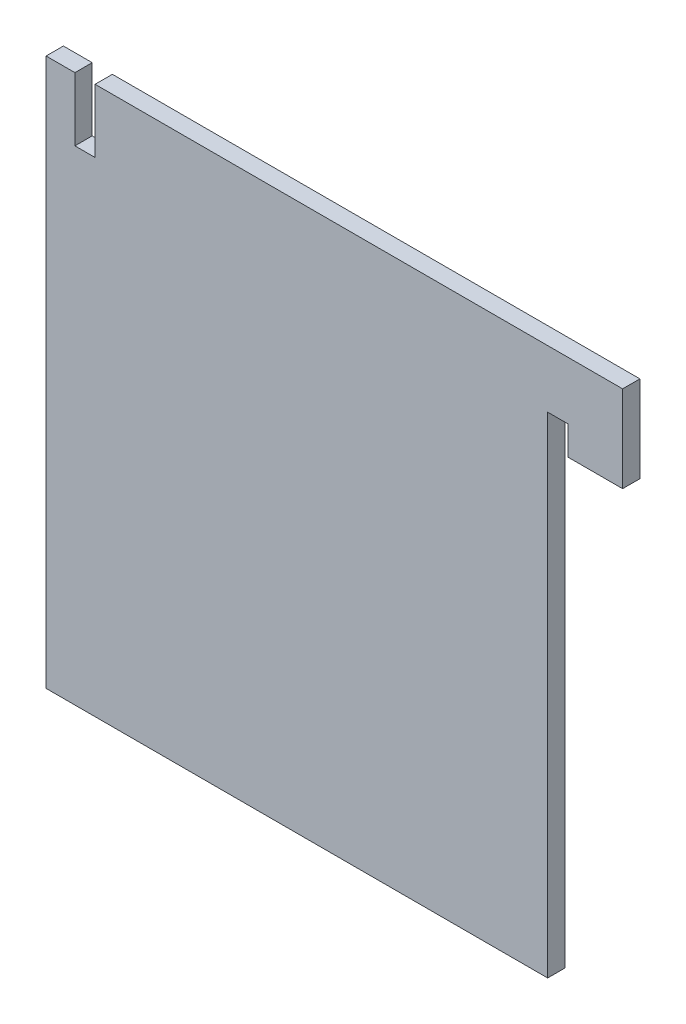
ISO-10303-21;
HEADER;
FILE_DESCRIPTION(('STEP AP214'),'2;1');
FILE_NAME('part.step','',(''),(''),'','','');
FILE_SCHEMA(('AUTOMOTIVE_DESIGN { 1 0 10303 214 1 1 1 1 }'));
ENDSEC;
DATA;
#1=APPLICATION_CONTEXT('core data for automotive mechanical design processes');
#2=APPLICATION_PROTOCOL_DEFINITION('international standard','automotive_design',2000,#1);
#3=PRODUCT_CONTEXT('',#1,'mechanical');
#4=PRODUCT('Part','Part','',(#3));
#5=PRODUCT_RELATED_PRODUCT_CATEGORY('part','',(#4));
#6=PRODUCT_DEFINITION_FORMATION('','',#4);
#7=PRODUCT_DEFINITION_CONTEXT('part definition',#1,'design');
#8=PRODUCT_DEFINITION('design','',#6,#7);
#9=PRODUCT_DEFINITION_SHAPE('','',#8);
#10=(LENGTH_UNIT() NAMED_UNIT(*) SI_UNIT(.MILLI.,.METRE.));
#11=(NAMED_UNIT(*) PLANE_ANGLE_UNIT() SI_UNIT($,.RADIAN.));
#12=(NAMED_UNIT(*) SI_UNIT($,.STERADIAN.) SOLID_ANGLE_UNIT());
#13=UNCERTAINTY_MEASURE_WITH_UNIT(LENGTH_MEASURE(1.E-05),#10,'distance_accuracy_value','');
#14=(GEOMETRIC_REPRESENTATION_CONTEXT(3) GLOBAL_UNCERTAINTY_ASSIGNED_CONTEXT((#13)) GLOBAL_UNIT_ASSIGNED_CONTEXT((#10,
#11,#12)) REPRESENTATION_CONTEXT('',''));
#15=CARTESIAN_POINT('',(0.,0.,0.));
#16=DIRECTION('',(0.,0.,1.));
#17=DIRECTION('',(1.,0.,0.));
#18=AXIS2_PLACEMENT_3D('',#15,#16,#17);
#19=CARTESIAN_POINT('',(0.,95.,3.));
#20=DIRECTION('',(0.,-1.,0.));
#21=DIRECTION('',(0.,0.,-1.));
#22=AXIS2_PLACEMENT_3D('',#19,#20,#21);
#23=PLANE('',#22);
#24=DIRECTION('',(-1.,0.,0.));
#25=VECTOR('',#24,1.);
#26=CARTESIAN_POINT('',(0.,95.,3.));
#27=LINE('',#26,#25);
#28=CARTESIAN_POINT('',(5.,95.,3.));
#29=VERTEX_POINT('',#28);
#30=CARTESIAN_POINT('',(0.,95.,3.));
#31=VERTEX_POINT('',#30);
#32=EDGE_CURVE('E194',#29,#31,#27,.T.);
#33=ORIENTED_EDGE('',*,*,#32,.F.);
#34=DIRECTION('',(0.,0.,1.));
#35=VECTOR('',#34,1.);
#36=CARTESIAN_POINT('',(5.,95.,0.));
#37=LINE('',#36,#35);
#38=CARTESIAN_POINT('',(5.,95.,0.));
#39=VERTEX_POINT('',#38);
#40=EDGE_CURVE('E163',#39,#29,#37,.T.);
#41=ORIENTED_EDGE('',*,*,#40,.F.);
#42=DIRECTION('',(-1.,0.,0.));
#43=VECTOR('',#42,1.);
#44=CARTESIAN_POINT('',(0.,95.,0.));
#45=LINE('',#44,#43);
#46=CARTESIAN_POINT('',(0.,95.,0.));
#47=VERTEX_POINT('',#46);
#48=EDGE_CURVE('E206',#39,#47,#45,.T.);
#49=ORIENTED_EDGE('',*,*,#48,.T.);
#50=DIRECTION('',(0.,0.,-1.));
#51=VECTOR('',#50,1.);
#52=CARTESIAN_POINT('',(0.,95.,3.));
#53=LINE('',#52,#51);
#54=EDGE_CURVE('E198',#31,#47,#53,.T.);
#55=ORIENTED_EDGE('',*,*,#54,.F.);
#56=EDGE_LOOP('',(#33,#41,#49,#55));
#57=FACE_BOUND('',#56,.T.);
#58=ADVANCED_FACE('F30',(#57),#23,.F.);
#59=CARTESIAN_POINT('',(0.,0.,3.));
#60=DIRECTION('',(1.,0.,0.));
#61=DIRECTION('',(0.,0.,-1.));
#62=AXIS2_PLACEMENT_3D('',#59,#60,#61);
#63=PLANE('',#62);
#64=DIRECTION('',(0.,-1.,0.));
#65=VECTOR('',#64,1.);
#66=CARTESIAN_POINT('',(0.,0.,0.));
#67=LINE('',#66,#65);
#68=CARTESIAN_POINT('',(0.,0.,0.));
#69=VERTEX_POINT('',#68);
#70=EDGE_CURVE('E183',#47,#69,#67,.T.);
#71=ORIENTED_EDGE('',*,*,#70,.T.);
#72=DIRECTION('',(0.,0.,-1.));
#73=VECTOR('',#72,1.);
#74=CARTESIAN_POINT('',(0.,0.,3.));
#75=LINE('',#74,#73);
#76=CARTESIAN_POINT('',(0.,0.,3.));
#77=VERTEX_POINT('',#76);
#78=EDGE_CURVE('E11',#77,#69,#75,.T.);
#79=ORIENTED_EDGE('',*,*,#78,.F.);
#80=DIRECTION('',(0.,-1.,0.));
#81=VECTOR('',#80,1.);
#82=CARTESIAN_POINT('',(0.,0.,3.));
#83=LINE('',#82,#81);
#84=EDGE_CURVE('E185',#31,#77,#83,.T.);
#85=ORIENTED_EDGE('',*,*,#84,.F.);
#86=ORIENTED_EDGE('',*,*,#54,.T.);
#87=EDGE_LOOP('',(#71,#79,#85,#86));
#88=FACE_BOUND('',#87,.T.);
#89=ADVANCED_FACE('F32',(#88),#63,.F.);
#90=CARTESIAN_POINT('',(0.,0.,3.));
#91=DIRECTION('',(0.,1.,0.));
#92=DIRECTION('',(0.,0.,1.));
#93=AXIS2_PLACEMENT_3D('',#90,#91,#92);
#94=PLANE('',#93);
#95=DIRECTION('',(1.,0.,0.));
#96=VECTOR('',#95,1.);
#97=CARTESIAN_POINT('',(0.,0.,0.));
#98=LINE('',#97,#96);
#99=CARTESIAN_POINT('',(87.,0.,0.));
#100=VERTEX_POINT('',#99);
#101=EDGE_CURVE('E201',#69,#100,#98,.T.);
#102=ORIENTED_EDGE('',*,*,#101,.T.);
#103=DIRECTION('',(0.,0.,1.));
#104=VECTOR('',#103,1.);
#105=CARTESIAN_POINT('',(87.,0.,0.));
#106=LINE('',#105,#104);
#107=CARTESIAN_POINT('',(87.,0.,3.));
#108=VERTEX_POINT('',#107);
#109=EDGE_CURVE('E180',#100,#108,#106,.T.);
#110=ORIENTED_EDGE('',*,*,#109,.T.);
#111=DIRECTION('',(1.,0.,0.));
#112=VECTOR('',#111,1.);
#113=CARTESIAN_POINT('',(0.,0.,3.));
#114=LINE('',#113,#112);
#115=EDGE_CURVE('E188',#77,#108,#114,.T.);
#116=ORIENTED_EDGE('',*,*,#115,.F.);
#117=ORIENTED_EDGE('',*,*,#78,.T.);
#118=EDGE_LOOP('',(#102,#110,#116,#117));
#119=FACE_BOUND('',#118,.T.);
#120=ADVANCED_FACE('F236',(#119),#94,.F.);
#121=CARTESIAN_POINT('',(100.,0.,3.));
#122=DIRECTION('',(-1.,0.,0.));
#123=DIRECTION('',(0.,0.,1.));
#124=AXIS2_PLACEMENT_3D('',#121,#122,#123);
#125=PLANE('',#124);
#126=DIRECTION('',(0.,1.,0.));
#127=VECTOR('',#126,1.);
#128=CARTESIAN_POINT('',(100.,0.,3.));
#129=LINE('',#128,#127);
#130=CARTESIAN_POINT('',(100.,80.,3.));
#131=VERTEX_POINT('',#130);
#132=CARTESIAN_POINT('',(100.,95.,3.));
#133=VERTEX_POINT('',#132);
#134=EDGE_CURVE('E192',#131,#133,#129,.T.);
#135=ORIENTED_EDGE('',*,*,#134,.F.);
#136=DIRECTION('',(0.,0.,1.));
#137=VECTOR('',#136,1.);
#138=CARTESIAN_POINT('',(100.,80.,0.));
#139=LINE('',#138,#137);
#140=CARTESIAN_POINT('',(100.,80.,0.));
#141=VERTEX_POINT('',#140);
#142=EDGE_CURVE('E176',#141,#131,#139,.T.);
#143=ORIENTED_EDGE('',*,*,#142,.F.);
#144=DIRECTION('',(0.,1.,0.));
#145=VECTOR('',#144,1.);
#146=CARTESIAN_POINT('',(100.,0.,0.));
#147=LINE('',#146,#145);
#148=CARTESIAN_POINT('',(100.,95.,0.));
#149=VERTEX_POINT('',#148);
#150=EDGE_CURVE('E204',#141,#149,#147,.T.);
#151=ORIENTED_EDGE('',*,*,#150,.T.);
#152=DIRECTION('',(0.,0.,-1.));
#153=VECTOR('',#152,1.);
#154=CARTESIAN_POINT('',(100.,95.,3.));
#155=LINE('',#154,#153);
#156=EDGE_CURVE('E38',#133,#149,#155,.T.);
#157=ORIENTED_EDGE('',*,*,#156,.F.);
#158=EDGE_LOOP('',(#135,#143,#151,#157));
#159=FACE_BOUND('',#158,.T.);
#160=ADVANCED_FACE('F229',(#159),#125,.F.);
#161=CARTESIAN_POINT('',(8.5,95.,0.));
#162=VERTEX_POINT('',#161);
#163=EDGE_CURVE('E189',#149,#162,#45,.T.);
#164=ORIENTED_EDGE('',*,*,#163,.T.);
#165=DIRECTION('',(0.,0.,1.));
#166=VECTOR('',#165,1.);
#167=CARTESIAN_POINT('',(8.5,95.,0.));
#168=LINE('',#167,#166);
#169=CARTESIAN_POINT('',(8.5,95.,3.));
#170=VERTEX_POINT('',#169);
#171=EDGE_CURVE('E166',#162,#170,#168,.T.);
#172=ORIENTED_EDGE('',*,*,#171,.T.);
#173=EDGE_CURVE('E195',#133,#170,#27,.T.);
#174=ORIENTED_EDGE('',*,*,#173,.F.);
#175=ORIENTED_EDGE('',*,*,#156,.T.);
#176=EDGE_LOOP('',(#164,#172,#174,#175));
#177=FACE_BOUND('',#176,.T.);
#178=ADVANCED_FACE('F215',(#177),#23,.F.);
#179=CARTESIAN_POINT('',(0.,95.,3.));
#180=DIRECTION('',(0.,0.,-1.));
#181=DIRECTION('',(-1.,0.,0.));
#182=AXIS2_PLACEMENT_3D('',#179,#180,#181);
#183=PLANE('',#182);
#184=DIRECTION('',(0.,-1.,0.));
#185=VECTOR('',#184,1.);
#186=CARTESIAN_POINT('',(87.,0.,3.));
#187=LINE('',#186,#185);
#188=CARTESIAN_POINT('',(87.,85.,3.));
#189=VERTEX_POINT('',#188);
#190=EDGE_CURVE('E174',#189,#108,#187,.T.);
#191=ORIENTED_EDGE('',*,*,#190,.F.);
#192=DIRECTION('',(-1.,0.,0.));
#193=VECTOR('',#192,1.);
#194=CARTESIAN_POINT('',(87.,85.,3.));
#195=LINE('',#194,#193);
#196=CARTESIAN_POINT('',(90.5,85.,3.));
#197=VERTEX_POINT('',#196);
#198=EDGE_CURVE('E140',#197,#189,#195,.T.);
#199=ORIENTED_EDGE('',*,*,#198,.F.);
#200=DIRECTION('',(0.,1.,0.));
#201=VECTOR('',#200,1.);
#202=CARTESIAN_POINT('',(90.5,80.,3.));
#203=LINE('',#202,#201);
#204=CARTESIAN_POINT('',(90.5,80.,3.));
#205=VERTEX_POINT('',#204);
#206=EDGE_CURVE('E121',#205,#197,#203,.T.);
#207=ORIENTED_EDGE('',*,*,#206,.F.);
#208=DIRECTION('',(-1.,0.,0.));
#209=VECTOR('',#208,1.);
#210=CARTESIAN_POINT('',(100.,80.,3.));
#211=LINE('',#210,#209);
#212=EDGE_CURVE('E165',#131,#205,#211,.T.);
#213=ORIENTED_EDGE('',*,*,#212,.F.);
#214=ORIENTED_EDGE('',*,*,#134,.T.);
#215=ORIENTED_EDGE('',*,*,#173,.T.);
#216=DIRECTION('',(0.,1.,0.));
#217=VECTOR('',#216,1.);
#218=CARTESIAN_POINT('',(8.5,95.,3.));
#219=LINE('',#218,#217);
#220=CARTESIAN_POINT('',(8.5,84.,3.));
#221=VERTEX_POINT('',#220);
#222=EDGE_CURVE('E152',#221,#170,#219,.T.);
#223=ORIENTED_EDGE('',*,*,#222,.F.);
#224=DIRECTION('',(1.,0.,0.));
#225=VECTOR('',#224,1.);
#226=CARTESIAN_POINT('',(5.,84.,3.));
#227=LINE('',#226,#225);
#228=CARTESIAN_POINT('',(5.,84.,3.));
#229=VERTEX_POINT('',#228);
#230=EDGE_CURVE('E159',#229,#221,#227,.T.);
#231=ORIENTED_EDGE('',*,*,#230,.F.);
#232=DIRECTION('',(0.,-1.,0.));
#233=VECTOR('',#232,1.);
#234=CARTESIAN_POINT('',(5.,95.,3.));
#235=LINE('',#234,#233);
#236=EDGE_CURVE('E145',#29,#229,#235,.T.);
#237=ORIENTED_EDGE('',*,*,#236,.F.);
#238=ORIENTED_EDGE('',*,*,#32,.T.);
#239=ORIENTED_EDGE('',*,*,#84,.T.);
#240=ORIENTED_EDGE('',*,*,#115,.T.);
#241=EDGE_LOOP('',(#191,#199,#207,#213,#214,#215,#223,#231,#237,#238,#239,#240));
#242=FACE_BOUND('',#241,.T.);
#243=ADVANCED_FACE('F226',(#242),#183,.F.);
#244=CARTESIAN_POINT('',(0.,95.,0.));
#245=DIRECTION('',(0.,0.,-1.));
#246=DIRECTION('',(-1.,0.,0.));
#247=AXIS2_PLACEMENT_3D('',#244,#245,#246);
#248=PLANE('',#247);
#249=DIRECTION('',(-1.,0.,0.));
#250=VECTOR('',#249,1.);
#251=CARTESIAN_POINT('',(87.,85.,0.));
#252=LINE('',#251,#250);
#253=CARTESIAN_POINT('',(90.5,85.,0.));
#254=VERTEX_POINT('',#253);
#255=CARTESIAN_POINT('',(87.,85.,0.));
#256=VERTEX_POINT('',#255);
#257=EDGE_CURVE('E130',#254,#256,#252,.T.);
#258=ORIENTED_EDGE('',*,*,#257,.T.);
#259=DIRECTION('',(0.,-1.,0.));
#260=VECTOR('',#259,1.);
#261=CARTESIAN_POINT('',(87.,0.,0.));
#262=LINE('',#261,#260);
#263=EDGE_CURVE('E173',#256,#100,#262,.T.);
#264=ORIENTED_EDGE('',*,*,#263,.T.);
#265=ORIENTED_EDGE('',*,*,#101,.F.);
#266=ORIENTED_EDGE('',*,*,#70,.F.);
#267=ORIENTED_EDGE('',*,*,#48,.F.);
#268=DIRECTION('',(0.,-1.,0.));
#269=VECTOR('',#268,1.);
#270=CARTESIAN_POINT('',(5.,95.,0.));
#271=LINE('',#270,#269);
#272=CARTESIAN_POINT('',(5.,84.,0.));
#273=VERTEX_POINT('',#272);
#274=EDGE_CURVE('E148',#39,#273,#271,.T.);
#275=ORIENTED_EDGE('',*,*,#274,.T.);
#276=DIRECTION('',(1.,0.,0.));
#277=VECTOR('',#276,1.);
#278=CARTESIAN_POINT('',(5.,84.,0.));
#279=LINE('',#278,#277);
#280=CARTESIAN_POINT('',(8.5,84.,0.));
#281=VERTEX_POINT('',#280);
#282=EDGE_CURVE('E151',#273,#281,#279,.T.);
#283=ORIENTED_EDGE('',*,*,#282,.T.);
#284=DIRECTION('',(0.,1.,0.));
#285=VECTOR('',#284,1.);
#286=CARTESIAN_POINT('',(8.5,95.,0.));
#287=LINE('',#286,#285);
#288=EDGE_CURVE('E53',#281,#162,#287,.T.);
#289=ORIENTED_EDGE('',*,*,#288,.T.);
#290=ORIENTED_EDGE('',*,*,#163,.F.);
#291=ORIENTED_EDGE('',*,*,#150,.F.);
#292=DIRECTION('',(-1.,0.,0.));
#293=VECTOR('',#292,1.);
#294=CARTESIAN_POINT('',(100.,80.,0.));
#295=LINE('',#294,#293);
#296=CARTESIAN_POINT('',(90.5,80.,0.));
#297=VERTEX_POINT('',#296);
#298=EDGE_CURVE('E139',#141,#297,#295,.T.);
#299=ORIENTED_EDGE('',*,*,#298,.T.);
#300=DIRECTION('',(0.,1.,0.));
#301=VECTOR('',#300,1.);
#302=CARTESIAN_POINT('',(90.5,80.,0.));
#303=LINE('',#302,#301);
#304=EDGE_CURVE('E45',#297,#254,#303,.T.);
#305=ORIENTED_EDGE('',*,*,#304,.T.);
#306=EDGE_LOOP('',(#258,#264,#265,#266,#267,#275,#283,#289,#290,#291,#299,#305));
#307=FACE_BOUND('',#306,.T.);
#308=ADVANCED_FACE('F137',(#307),#248,.T.);
#309=CARTESIAN_POINT('',(87.,0.,0.));
#310=DIRECTION('',(-1.,0.,0.));
#311=DIRECTION('',(0.,0.,1.));
#312=AXIS2_PLACEMENT_3D('',#309,#310,#311);
#313=PLANE('',#312);
#314=ORIENTED_EDGE('',*,*,#190,.T.);
#315=ORIENTED_EDGE('',*,*,#109,.F.);
#316=ORIENTED_EDGE('',*,*,#263,.F.);
#317=DIRECTION('',(0.,0.,1.));
#318=VECTOR('',#317,1.);
#319=CARTESIAN_POINT('',(87.,85.,0.));
#320=LINE('',#319,#318);
#321=EDGE_CURVE('E125',#256,#189,#320,.T.);
#322=ORIENTED_EDGE('',*,*,#321,.T.);
#323=EDGE_LOOP('',(#314,#315,#316,#322));
#324=FACE_BOUND('',#323,.T.);
#325=ADVANCED_FACE('F233',(#324),#313,.F.);
#326=CARTESIAN_POINT('',(100.,80.,0.));
#327=DIRECTION('',(0.,1.,0.));
#328=DIRECTION('',(0.,0.,1.));
#329=AXIS2_PLACEMENT_3D('',#326,#327,#328);
#330=PLANE('',#329);
#331=ORIENTED_EDGE('',*,*,#212,.T.);
#332=DIRECTION('',(0.,0.,1.));
#333=VECTOR('',#332,1.);
#334=CARTESIAN_POINT('',(90.5,80.,0.));
#335=LINE('',#334,#333);
#336=EDGE_CURVE('E126',#297,#205,#335,.T.);
#337=ORIENTED_EDGE('',*,*,#336,.F.);
#338=ORIENTED_EDGE('',*,*,#298,.F.);
#339=ORIENTED_EDGE('',*,*,#142,.T.);
#340=EDGE_LOOP('',(#331,#337,#338,#339));
#341=FACE_BOUND('',#340,.T.);
#342=ADVANCED_FACE('F231',(#341),#330,.F.);
#343=CARTESIAN_POINT('',(5.,95.,0.));
#344=DIRECTION('',(-1.,0.,0.));
#345=DIRECTION('',(0.,-1.,0.));
#346=AXIS2_PLACEMENT_3D('',#343,#344,#345);
#347=PLANE('',#346);
#348=ORIENTED_EDGE('',*,*,#236,.T.);
#349=DIRECTION('',(0.,0.,1.));
#350=VECTOR('',#349,1.);
#351=CARTESIAN_POINT('',(5.,84.,0.));
#352=LINE('',#351,#350);
#353=EDGE_CURVE('E156',#273,#229,#352,.T.);
#354=ORIENTED_EDGE('',*,*,#353,.F.);
#355=ORIENTED_EDGE('',*,*,#274,.F.);
#356=ORIENTED_EDGE('',*,*,#40,.T.);
#357=EDGE_LOOP('',(#348,#354,#355,#356));
#358=FACE_BOUND('',#357,.T.);
#359=ADVANCED_FACE('F246',(#358),#347,.F.);
#360=CARTESIAN_POINT('',(8.5,95.,0.));
#361=DIRECTION('',(1.,0.,0.));
#362=DIRECTION('',(0.,0.,-1.));
#363=AXIS2_PLACEMENT_3D('',#360,#361,#362);
#364=PLANE('',#363);
#365=ORIENTED_EDGE('',*,*,#222,.T.);
#366=ORIENTED_EDGE('',*,*,#171,.F.);
#367=ORIENTED_EDGE('',*,*,#288,.F.);
#368=DIRECTION('',(0.,0.,1.));
#369=VECTOR('',#368,1.);
#370=CARTESIAN_POINT('',(8.5,84.,0.));
#371=LINE('',#370,#369);
#372=EDGE_CURVE('E169',#281,#221,#371,.T.);
#373=ORIENTED_EDGE('',*,*,#372,.T.);
#374=EDGE_LOOP('',(#365,#366,#367,#373));
#375=FACE_BOUND('',#374,.T.);
#376=ADVANCED_FACE('F224',(#375),#364,.F.);
#377=CARTESIAN_POINT('',(5.,84.,0.));
#378=DIRECTION('',(0.,-1.,0.));
#379=DIRECTION('',(0.,0.,-1.));
#380=AXIS2_PLACEMENT_3D('',#377,#378,#379);
#381=PLANE('',#380);
#382=ORIENTED_EDGE('',*,*,#230,.T.);
#383=ORIENTED_EDGE('',*,*,#372,.F.);
#384=ORIENTED_EDGE('',*,*,#282,.F.);
#385=ORIENTED_EDGE('',*,*,#353,.T.);
#386=EDGE_LOOP('',(#382,#383,#384,#385));
#387=FACE_BOUND('',#386,.T.);
#388=ADVANCED_FACE('F221',(#387),#381,.F.);
#389=CARTESIAN_POINT('',(87.,85.,0.));
#390=DIRECTION('',(0.,1.,0.));
#391=DIRECTION('',(0.,0.,1.));
#392=AXIS2_PLACEMENT_3D('',#389,#390,#391);
#393=PLANE('',#392);
#394=ORIENTED_EDGE('',*,*,#198,.T.);
#395=ORIENTED_EDGE('',*,*,#321,.F.);
#396=ORIENTED_EDGE('',*,*,#257,.F.);
#397=DIRECTION('',(0.,0.,1.));
#398=VECTOR('',#397,1.);
#399=CARTESIAN_POINT('',(90.5,85.,0.));
#400=LINE('',#399,#398);
#401=EDGE_CURVE('E117',#254,#197,#400,.T.);
#402=ORIENTED_EDGE('',*,*,#401,.T.);
#403=EDGE_LOOP('',(#394,#395,#396,#402));
#404=FACE_BOUND('',#403,.T.);
#405=ADVANCED_FACE('F131',(#404),#393,.F.);
#406=CARTESIAN_POINT('',(90.5,80.,0.));
#407=DIRECTION('',(1.,0.,0.));
#408=DIRECTION('',(0.,0.,-1.));
#409=AXIS2_PLACEMENT_3D('',#406,#407,#408);
#410=PLANE('',#409);
#411=ORIENTED_EDGE('',*,*,#206,.T.);
#412=ORIENTED_EDGE('',*,*,#401,.F.);
#413=ORIENTED_EDGE('',*,*,#304,.F.);
#414=ORIENTED_EDGE('',*,*,#336,.T.);
#415=EDGE_LOOP('',(#411,#412,#413,#414));
#416=FACE_BOUND('',#415,.T.);
#417=ADVANCED_FACE('F119',(#416),#410,.F.);
#418=CLOSED_SHELL('',(#58,#89,#120,#160,#178,#243,#308,#325,#342,#359,#376,#388,#405,#417));
#419=MANIFOLD_SOLID_BREP('B2',#418);
#420=ADVANCED_BREP_SHAPE_REPRESENTATION('',(#18,#419),#14);
#421=SHAPE_DEFINITION_REPRESENTATION(#9,#420);
ENDSEC;
END-ISO-10303-21;
